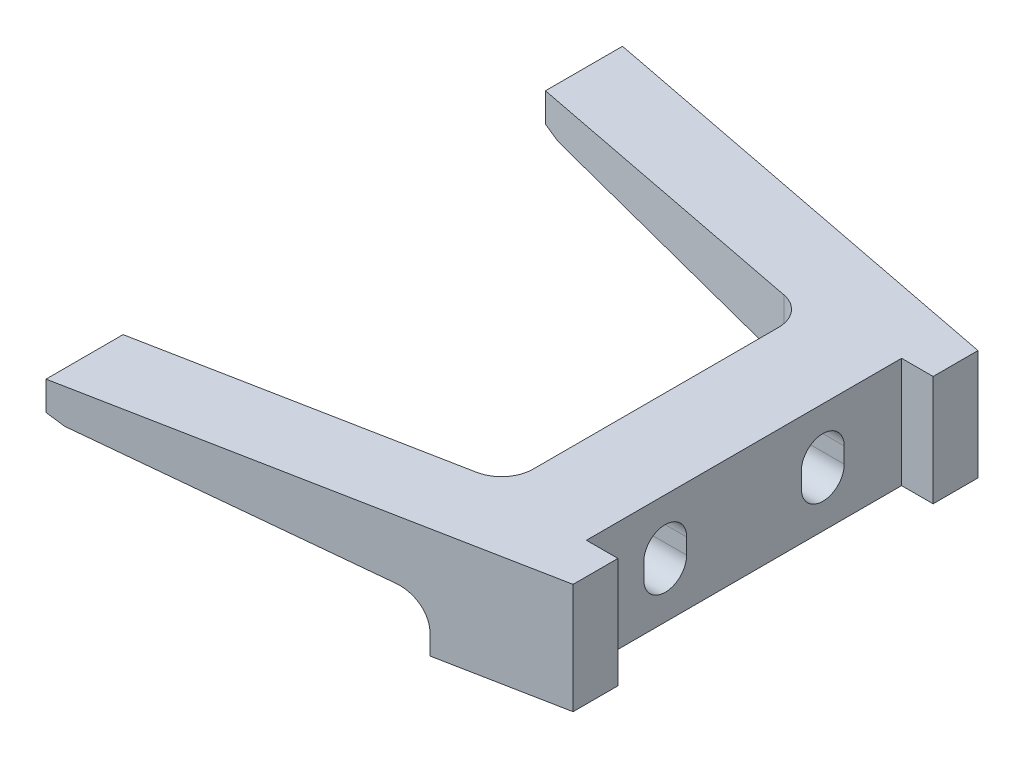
ISO-10303-21;
HEADER;
FILE_DESCRIPTION(('STEP AP214'),'2;1');
FILE_NAME('part.step','',(''),(''),'','','');
FILE_SCHEMA(('AUTOMOTIVE_DESIGN { 1 0 10303 214 1 1 1 1 }'));
ENDSEC;
DATA;
#1=APPLICATION_CONTEXT('core data for automotive mechanical design processes');
#2=APPLICATION_PROTOCOL_DEFINITION('international standard','automotive_design',2000,#1);
#3=PRODUCT_CONTEXT('',#1,'mechanical');
#4=PRODUCT('Part','Part','',(#3));
#5=PRODUCT_RELATED_PRODUCT_CATEGORY('part','',(#4));
#6=PRODUCT_DEFINITION_FORMATION('','',#4);
#7=PRODUCT_DEFINITION_CONTEXT('part definition',#1,'design');
#8=PRODUCT_DEFINITION('design','',#6,#7);
#9=PRODUCT_DEFINITION_SHAPE('','',#8);
#10=(LENGTH_UNIT() NAMED_UNIT(*) SI_UNIT(.MILLI.,.METRE.));
#11=(NAMED_UNIT(*) PLANE_ANGLE_UNIT() SI_UNIT($,.RADIAN.));
#12=(NAMED_UNIT(*) SI_UNIT($,.STERADIAN.) SOLID_ANGLE_UNIT());
#13=UNCERTAINTY_MEASURE_WITH_UNIT(LENGTH_MEASURE(1.E-05),#10,'distance_accuracy_value','');
#14=(GEOMETRIC_REPRESENTATION_CONTEXT(3) GLOBAL_UNCERTAINTY_ASSIGNED_CONTEXT((#13)) GLOBAL_UNIT_ASSIGNED_CONTEXT((#10,
#11,#12)) REPRESENTATION_CONTEXT('',''));
#15=CARTESIAN_POINT('',(0.,0.,0.));
#16=DIRECTION('',(0.,0.,1.));
#17=DIRECTION('',(1.,0.,0.));
#18=AXIS2_PLACEMENT_3D('',#15,#16,#17);
#19=CARTESIAN_POINT('',(-9.652,-5.7912,11.9819949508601));
#20=DIRECTION('',(1.,0.,0.));
#21=DIRECTION('',(0.,0.,-1.));
#22=AXIS2_PLACEMENT_3D('',#19,#20,#21);
#23=PLANE('',#22);
#24=DIRECTION('',(0.,0.,1.));
#25=VECTOR('',#24,1.);
#26=CARTESIAN_POINT('',(-9.652,-7.27424060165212,11.9819949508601));
#27=LINE('',#26,#25);
#28=CARTESIAN_POINT('',(-9.652,-7.27424060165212,18.1920919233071));
#29=VERTEX_POINT('',#28);
#30=CARTESIAN_POINT('',(-9.652,-7.27424060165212,9.88818053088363));
#31=VERTEX_POINT('',#30);
#32=EDGE_CURVE('E462',#29,#31,#27,.F.);
#33=ORIENTED_EDGE('',*,*,#32,.T.);
#34=DIRECTION('',(0.,1.,0.));
#35=VECTOR('',#34,1.);
#36=CARTESIAN_POINT('',(-9.652,0.,9.88818053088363));
#37=LINE('',#36,#35);
#38=CARTESIAN_POINT('',(-9.652,0.,9.88818053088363));
#39=VERTEX_POINT('',#38);
#40=EDGE_CURVE('E382',#31,#39,#37,.T.);
#41=ORIENTED_EDGE('',*,*,#40,.T.);
#42=DIRECTION('',(0.,0.,-1.));
#43=VECTOR('',#42,1.);
#44=CARTESIAN_POINT('',(-9.652,0.,11.9819949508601));
#45=LINE('',#44,#43);
#46=CARTESIAN_POINT('',(-9.652,0.,-9.88818053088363));
#47=VERTEX_POINT('',#46);
#48=EDGE_CURVE('E346',#39,#47,#45,.T.);
#49=ORIENTED_EDGE('',*,*,#48,.T.);
#50=DIRECTION('',(0.,1.,0.));
#51=VECTOR('',#50,1.);
#52=CARTESIAN_POINT('',(-9.652,-5.7912,-9.88818053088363));
#53=LINE('',#52,#51);
#54=CARTESIAN_POINT('',(-9.652,-7.27424060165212,-9.88818053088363));
#55=VERTEX_POINT('',#54);
#56=EDGE_CURVE('E379',#47,#55,#53,.F.);
#57=ORIENTED_EDGE('',*,*,#56,.T.);
#58=DIRECTION('',(0.,0.,-1.));
#59=VECTOR('',#58,1.);
#60=CARTESIAN_POINT('',(-9.652,-7.27424060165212,-18.1920919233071));
#61=LINE('',#60,#59);
#62=CARTESIAN_POINT('',(-9.652,-7.27424060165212,-18.1920919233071));
#63=VERTEX_POINT('',#62);
#64=EDGE_CURVE('E413',#55,#63,#61,.T.);
#65=ORIENTED_EDGE('',*,*,#64,.T.);
#66=DIRECTION('',(0.,1.,0.));
#67=VECTOR('',#66,1.);
#68=CARTESIAN_POINT('',(-9.652,-8.89,-18.1920919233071));
#69=LINE('',#68,#67);
#70=CARTESIAN_POINT('',(-9.652,-8.89,-18.1920919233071));
#71=VERTEX_POINT('',#70);
#72=EDGE_CURVE('E289',#71,#63,#69,.T.);
#73=ORIENTED_EDGE('',*,*,#72,.F.);
#74=DIRECTION('',(0.,0.,1.));
#75=VECTOR('',#74,1.);
#76=CARTESIAN_POINT('',(-9.652,-8.89,18.1920919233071));
#77=LINE('',#76,#75);
#78=CARTESIAN_POINT('',(-9.652,-8.89,18.1920919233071));
#79=VERTEX_POINT('',#78);
#80=EDGE_CURVE('E292',#71,#79,#77,.T.);
#81=ORIENTED_EDGE('',*,*,#80,.T.);
#82=DIRECTION('',(0.,1.,0.));
#83=VECTOR('',#82,1.);
#84=CARTESIAN_POINT('',(-9.652,-8.89,18.1920919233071));
#85=LINE('',#84,#83);
#86=EDGE_CURVE('E307',#79,#29,#85,.T.);
#87=ORIENTED_EDGE('',*,*,#86,.T.);
#88=EDGE_LOOP('',(#33,#41,#49,#57,#65,#73,#81,#87));
#89=FACE_BOUND('',#88,.T.);
#90=DIRECTION('',(0.,-1.,0.));
#91=VECTOR('',#90,1.);
#92=CARTESIAN_POINT('',(-9.652,-5.7912,8.0772));
#93=LINE('',#92,#91);
#94=CARTESIAN_POINT('',(-9.652,-3.81,8.0772));
#95=VERTEX_POINT('',#94);
#96=CARTESIAN_POINT('',(-9.652,-5.08,8.0772));
#97=VERTEX_POINT('',#96);
#98=EDGE_CURVE('E274',#95,#97,#93,.T.);
#99=ORIENTED_EDGE('',*,*,#98,.T.);
#100=CARTESIAN_POINT('',(-9.652,-5.08,6.35));
#101=DIRECTION('',(1.,0.,0.));
#102=DIRECTION('',(0.,0.,-1.));
#103=AXIS2_PLACEMENT_3D('',#100,#101,#102);
#104=CIRCLE('',#103,1.7272);
#105=CARTESIAN_POINT('',(-9.652,-5.08,4.6228));
#106=VERTEX_POINT('',#105);
#107=EDGE_CURVE('E277',#97,#106,#104,.T.);
#108=ORIENTED_EDGE('',*,*,#107,.T.);
#109=DIRECTION('',(0.,1.,0.));
#110=VECTOR('',#109,1.);
#111=CARTESIAN_POINT('',(-9.652,-5.79120000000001,4.6228));
#112=LINE('',#111,#110);
#113=CARTESIAN_POINT('',(-9.652,-3.81,4.6228));
#114=VERTEX_POINT('',#113);
#115=EDGE_CURVE('E262',#106,#114,#112,.T.);
#116=ORIENTED_EDGE('',*,*,#115,.T.);
#117=CARTESIAN_POINT('',(-9.652,-3.81,6.35));
#118=DIRECTION('',(1.,0.,0.));
#119=DIRECTION('',(0.,0.,-1.));
#120=AXIS2_PLACEMENT_3D('',#117,#118,#119);
#121=CIRCLE('',#120,1.7272);
#122=EDGE_CURVE('E271',#114,#95,#121,.T.);
#123=ORIENTED_EDGE('',*,*,#122,.T.);
#124=EDGE_LOOP('',(#99,#108,#116,#123));
#125=FACE_BOUND('',#124,.T.);
#126=CARTESIAN_POINT('',(-9.652,-5.08,-6.35));
#127=DIRECTION('',(1.,0.,0.));
#128=DIRECTION('',(0.,0.,-1.));
#129=AXIS2_PLACEMENT_3D('',#126,#127,#128);
#130=CIRCLE('',#129,1.7272);
#131=CARTESIAN_POINT('',(-9.652,-5.08,-8.0772));
#132=VERTEX_POINT('',#131);
#133=CARTESIAN_POINT('',(-9.652,-5.08,-4.6228));
#134=VERTEX_POINT('',#133);
#135=EDGE_CURVE('E246',#132,#134,#130,.F.);
#136=ORIENTED_EDGE('',*,*,#135,.F.);
#137=DIRECTION('',(0.,-1.,0.));
#138=VECTOR('',#137,1.);
#139=CARTESIAN_POINT('',(-9.652,-5.7912,-8.0772));
#140=LINE('',#139,#138);
#141=CARTESIAN_POINT('',(-9.652,-3.81,-8.0772));
#142=VERTEX_POINT('',#141);
#143=EDGE_CURVE('E239',#142,#132,#140,.T.);
#144=ORIENTED_EDGE('',*,*,#143,.F.);
#145=CARTESIAN_POINT('',(-9.652,-3.81,-6.35));
#146=DIRECTION('',(1.,0.,0.));
#147=DIRECTION('',(0.,0.,-1.));
#148=AXIS2_PLACEMENT_3D('',#145,#146,#147);
#149=CIRCLE('',#148,1.7272);
#150=CARTESIAN_POINT('',(-9.652,-3.81,-4.6228));
#151=VERTEX_POINT('',#150);
#152=EDGE_CURVE('E220',#151,#142,#149,.F.);
#153=ORIENTED_EDGE('',*,*,#152,.F.);
#154=DIRECTION('',(0.,1.,0.));
#155=VECTOR('',#154,1.);
#156=CARTESIAN_POINT('',(-9.652,-5.79119999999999,-4.6228));
#157=LINE('',#156,#155);
#158=EDGE_CURVE('E244',#134,#151,#157,.T.);
#159=ORIENTED_EDGE('',*,*,#158,.F.);
#160=EDGE_LOOP('',(#136,#144,#153,#159));
#161=FACE_BOUND('',#160,.T.);
#162=ADVANCED_FACE('F30',(#89,#125,#161),#23,.F.);
#163=CARTESIAN_POINT('',(-2.54,0.,-12.7));
#164=DIRECTION('',(1.,0.,0.));
#165=DIRECTION('',(0.,1.,0.));
#166=AXIS2_PLACEMENT_3D('',#163,#164,#165);
#167=PLANE('',#166);
#168=DIRECTION('',(0.,0.,-1.));
#169=VECTOR('',#168,1.);
#170=CARTESIAN_POINT('',(-2.54,-8.89,12.7));
#171=LINE('',#170,#169);
#172=CARTESIAN_POINT('',(-2.54,-8.89,12.7));
#173=VERTEX_POINT('',#172);
#174=CARTESIAN_POINT('',(-2.54,-8.89,-12.7));
#175=VERTEX_POINT('',#174);
#176=EDGE_CURVE('E304',#173,#175,#171,.T.);
#177=ORIENTED_EDGE('',*,*,#176,.T.);
#178=DIRECTION('',(0.,1.,0.));
#179=VECTOR('',#178,1.);
#180=CARTESIAN_POINT('',(-2.54,-9.70919330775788,-12.7));
#181=LINE('',#180,#179);
#182=CARTESIAN_POINT('',(-2.54,0.,-12.7));
#183=VERTEX_POINT('',#182);
#184=EDGE_CURVE('E318',#175,#183,#181,.T.);
#185=ORIENTED_EDGE('',*,*,#184,.T.);
#186=DIRECTION('',(0.,0.,1.));
#187=VECTOR('',#186,1.);
#188=CARTESIAN_POINT('',(-2.54,0.,-12.7));
#189=LINE('',#188,#187);
#190=CARTESIAN_POINT('',(-2.54,0.,12.7));
#191=VERTEX_POINT('',#190);
#192=EDGE_CURVE('E320',#183,#191,#189,.T.);
#193=ORIENTED_EDGE('',*,*,#192,.T.);
#194=DIRECTION('',(0.,1.,0.));
#195=VECTOR('',#194,1.);
#196=CARTESIAN_POINT('',(-2.54,-9.70919330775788,12.7));
#197=LINE('',#196,#195);
#198=EDGE_CURVE('E313',#173,#191,#197,.T.);
#199=ORIENTED_EDGE('',*,*,#198,.F.);
#200=EDGE_LOOP('',(#177,#185,#193,#199));
#201=FACE_BOUND('',#200,.T.);
#202=CARTESIAN_POINT('',(-2.54,-5.08,6.35));
#203=DIRECTION('',(1.,0.,0.));
#204=DIRECTION('',(0.,1.,0.));
#205=AXIS2_PLACEMENT_3D('',#202,#203,#204);
#206=CIRCLE('',#205,1.7272);
#207=CARTESIAN_POINT('',(-2.54,-5.08,8.0772));
#208=VERTEX_POINT('',#207);
#209=CARTESIAN_POINT('',(-2.54,-5.08,4.6228));
#210=VERTEX_POINT('',#209);
#211=EDGE_CURVE('E248',#208,#210,#206,.T.);
#212=ORIENTED_EDGE('',*,*,#211,.F.);
#213=DIRECTION('',(0.,-1.,0.));
#214=VECTOR('',#213,1.);
#215=CARTESIAN_POINT('',(-2.54,-5.08,8.0772));
#216=LINE('',#215,#214);
#217=CARTESIAN_POINT('',(-2.54,-3.81,8.0772));
#218=VERTEX_POINT('',#217);
#219=EDGE_CURVE('E256',#218,#208,#216,.T.);
#220=ORIENTED_EDGE('',*,*,#219,.F.);
#221=CARTESIAN_POINT('',(-2.54,-3.81,6.35));
#222=DIRECTION('',(1.,0.,0.));
#223=DIRECTION('',(0.,1.,0.));
#224=AXIS2_PLACEMENT_3D('',#221,#222,#223);
#225=CIRCLE('',#224,1.7272);
#226=CARTESIAN_POINT('',(-2.54,-3.81,4.6228));
#227=VERTEX_POINT('',#226);
#228=EDGE_CURVE('E253',#227,#218,#225,.T.);
#229=ORIENTED_EDGE('',*,*,#228,.F.);
#230=DIRECTION('',(0.,1.,0.));
#231=VECTOR('',#230,1.);
#232=CARTESIAN_POINT('',(-2.54,-5.08,4.6228));
#233=LINE('',#232,#231);
#234=EDGE_CURVE('E250',#210,#227,#233,.T.);
#235=ORIENTED_EDGE('',*,*,#234,.F.);
#236=EDGE_LOOP('',(#212,#220,#229,#235));
#237=FACE_BOUND('',#236,.T.);
#238=DIRECTION('',(0.,-1.,0.));
#239=VECTOR('',#238,1.);
#240=CARTESIAN_POINT('',(-2.54,-5.08,-8.0772));
#241=LINE('',#240,#239);
#242=CARTESIAN_POINT('',(-2.54,-3.81,-8.0772));
#243=VERTEX_POINT('',#242);
#244=CARTESIAN_POINT('',(-2.54,-5.08,-8.0772));
#245=VERTEX_POINT('',#244);
#246=EDGE_CURVE('E226',#243,#245,#241,.T.);
#247=ORIENTED_EDGE('',*,*,#246,.T.);
#248=CARTESIAN_POINT('',(-2.54,-5.08,-6.35));
#249=DIRECTION('',(-1.,0.,0.));
#250=DIRECTION('',(0.,1.,0.));
#251=AXIS2_PLACEMENT_3D('',#248,#249,#250);
#252=CIRCLE('',#251,1.7272);
#253=CARTESIAN_POINT('',(-2.54,-5.08,-4.6228));
#254=VERTEX_POINT('',#253);
#255=EDGE_CURVE('E53',#245,#254,#252,.T.);
#256=ORIENTED_EDGE('',*,*,#255,.T.);
#257=DIRECTION('',(0.,1.,0.));
#258=VECTOR('',#257,1.);
#259=CARTESIAN_POINT('',(-2.54,-5.08,-4.6228));
#260=LINE('',#259,#258);
#261=CARTESIAN_POINT('',(-2.54,-3.81,-4.6228));
#262=VERTEX_POINT('',#261);
#263=EDGE_CURVE('E232',#254,#262,#260,.T.);
#264=ORIENTED_EDGE('',*,*,#263,.T.);
#265=CARTESIAN_POINT('',(-2.54,-3.81,-6.35));
#266=DIRECTION('',(-1.,0.,0.));
#267=DIRECTION('',(0.,1.,0.));
#268=AXIS2_PLACEMENT_3D('',#265,#266,#267);
#269=CIRCLE('',#268,1.7272);
#270=EDGE_CURVE('E217',#262,#243,#269,.T.);
#271=ORIENTED_EDGE('',*,*,#270,.T.);
#272=EDGE_LOOP('',(#247,#256,#264,#271));
#273=FACE_BOUND('',#272,.T.);
#274=ADVANCED_FACE('F230',(#201,#237,#273),#167,.T.);
#275=CARTESIAN_POINT('',(0.,-5.7912,25.4));
#276=DIRECTION('',(0.0871557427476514,0.996194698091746,0.));
#277=DIRECTION('',(-0.996194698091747,0.0871557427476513,0.));
#278=AXIS2_PLACEMENT_3D('',#275,#276,#277);
#279=PLANE('',#278);
#280=DIRECTION('',(0.978027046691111,-0.085566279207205,0.190109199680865));
#281=VECTOR('',#280,1.);
#282=CARTESIAN_POINT('',(6.60166897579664,-6.36877119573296,-8.82260175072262));
#283=LINE('',#282,#281);
#284=CARTESIAN_POINT('',(-34.2948327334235,-2.79079091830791,-16.7720763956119));
#285=VERTEX_POINT('',#284);
#286=CARTESIAN_POINT('',(-11.970624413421,-4.74390606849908,-12.4326898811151));
#287=VERTEX_POINT('',#286);
#288=EDGE_CURVE('E330',#285,#287,#283,.T.);
#289=ORIENTED_EDGE('',*,*,#288,.F.);
#290=DIRECTION('',(0.,0.,-1.));
#291=VECTOR('',#290,1.);
#292=CARTESIAN_POINT('',(-34.2948327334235,-2.79079091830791,-23.228096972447));
#293=LINE('',#292,#291);
#294=CARTESIAN_POINT('',(-34.2948327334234,-2.79079091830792,-22.9821733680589));
#295=VERTEX_POINT('',#294);
#296=EDGE_CURVE('E437',#285,#295,#293,.T.);
#297=ORIENTED_EDGE('',*,*,#296,.T.);
#298=DIRECTION('',(-0.978027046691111,0.085566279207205,-0.190109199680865));
#299=VECTOR('',#298,1.);
#300=CARTESIAN_POINT('',(7.75632434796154,-6.46979045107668,-14.8082564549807));
#301=LINE('',#300,#299);
#302=CARTESIAN_POINT('',(-11.970624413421,-4.74390606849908,-18.6427868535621));
#303=VERTEX_POINT('',#302);
#304=EDGE_CURVE('E337',#303,#295,#301,.T.);
#305=ORIENTED_EDGE('',*,*,#304,.F.);
#306=DIRECTION('',(0.,0.,-1.));
#307=VECTOR('',#306,1.);
#308=CARTESIAN_POINT('',(-11.970624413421,-4.74390606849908,-11.9819949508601));
#309=LINE('',#308,#307);
#310=EDGE_CURVE('E424',#303,#287,#309,.F.);
#311=ORIENTED_EDGE('',*,*,#310,.T.);
#312=EDGE_LOOP('',(#289,#297,#305,#311));
#313=FACE_BOUND('',#312,.T.);
#314=ADVANCED_FACE('F455',(#313),#279,.F.);
#315=DIRECTION('',(-0.978027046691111,0.085566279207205,0.190109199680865));
#316=VECTOR('',#315,1.);
#317=CARTESIAN_POINT('',(-1.68901815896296,-5.64343005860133,16.6442450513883));
#318=LINE('',#317,#316);
#319=CARTESIAN_POINT('',(-11.970624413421,-4.74390606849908,18.6427868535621));
#320=VERTEX_POINT('',#319);
#321=CARTESIAN_POINT('',(-34.2948327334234,-2.79079091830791,22.9821733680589));
#322=VERTEX_POINT('',#321);
#323=EDGE_CURVE('E357',#320,#322,#318,.T.);
#324=ORIENTED_EDGE('',*,*,#323,.T.);
#325=DIRECTION('',(0.,0.,-1.));
#326=VECTOR('',#325,1.);
#327=CARTESIAN_POINT('',(-34.2948327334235,-2.79079091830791,25.4));
#328=LINE('',#327,#326);
#329=CARTESIAN_POINT('',(-34.2948327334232,-2.79079091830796,16.7720763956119));
#330=VERTEX_POINT('',#329);
#331=EDGE_CURVE('E418',#322,#330,#328,.T.);
#332=ORIENTED_EDGE('',*,*,#331,.T.);
#333=DIRECTION('',(0.978027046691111,-0.085566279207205,-0.190109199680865));
#334=VECTOR('',#333,1.);
#335=CARTESIAN_POINT('',(-2.84367353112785,-5.5424108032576,10.6585903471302));
#336=LINE('',#335,#334);
#337=CARTESIAN_POINT('',(-11.970624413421,-4.74390606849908,12.4326898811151));
#338=VERTEX_POINT('',#337);
#339=EDGE_CURVE('E349',#330,#338,#336,.T.);
#340=ORIENTED_EDGE('',*,*,#339,.T.);
#341=DIRECTION('',(0.,0.,1.));
#342=VECTOR('',#341,1.);
#343=CARTESIAN_POINT('',(-11.970624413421,-4.74390606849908,18.1920919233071));
#344=LINE('',#343,#342);
#345=EDGE_CURVE('E464',#338,#320,#344,.T.);
#346=ORIENTED_EDGE('',*,*,#345,.T.);
#347=EDGE_LOOP('',(#324,#332,#340,#346));
#348=FACE_BOUND('',#347,.T.);
#349=ADVANCED_FACE('F518',(#348),#279,.F.);
#350=CARTESIAN_POINT('',(-35.56,0.,25.4));
#351=DIRECTION('',(0.,-1.,0.));
#352=DIRECTION('',(0.,0.,-1.));
#353=AXIS2_PLACEMENT_3D('',#350,#351,#352);
#354=PLANE('',#353);
#355=DIRECTION('',(-0.981627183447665,0.,-0.190808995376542));
#356=VECTOR('',#355,1.);
#357=CARTESIAN_POINT('',(0.,0.,-16.3159331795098));
#358=LINE('',#357,#356);
#359=CARTESIAN_POINT('',(0.,0.,-16.3159331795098));
#360=VERTEX_POINT('',#359);
#361=CARTESIAN_POINT('',(-35.56,0.,-23.228096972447));
#362=VERTEX_POINT('',#361);
#363=EDGE_CURVE('E332',#360,#362,#358,.T.);
#364=ORIENTED_EDGE('',*,*,#363,.T.);
#365=DIRECTION('',(0.,0.,1.));
#366=VECTOR('',#365,1.);
#367=CARTESIAN_POINT('',(-35.56,0.,-25.4));
#368=LINE('',#367,#366);
#369=CARTESIAN_POINT('',(-35.56,0.,-17.018));
#370=VERTEX_POINT('',#369);
#371=EDGE_CURVE('E340',#362,#370,#368,.T.);
#372=ORIENTED_EDGE('',*,*,#371,.T.);
#373=DIRECTION('',(0.981627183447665,0.,0.190808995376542));
#374=VECTOR('',#373,1.);
#375=CARTESIAN_POINT('',(-35.56,0.,-17.018));
#376=LINE('',#375,#374);
#377=CARTESIAN_POINT('',(-11.7073451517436,0.,-12.3815135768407));
#378=VERTEX_POINT('',#377);
#379=EDGE_CURVE('E325',#370,#378,#376,.T.);
#380=ORIENTED_EDGE('',*,*,#379,.T.);
#381=CARTESIAN_POINT('',(-12.192,0.,-9.88818053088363));
#382=DIRECTION('',(0.,-1.,0.));
#383=DIRECTION('',(0.,0.,-1.));
#384=AXIS2_PLACEMENT_3D('',#381,#382,#383);
#385=CIRCLE('',#384,2.54);
#386=EDGE_CURVE('E38',#378,#47,#385,.T.);
#387=ORIENTED_EDGE('',*,*,#386,.T.);
#388=ORIENTED_EDGE('',*,*,#48,.F.);
#389=CARTESIAN_POINT('',(-12.192,0.,9.88818053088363));
#390=DIRECTION('',(0.,-1.,0.));
#391=DIRECTION('',(0.,0.,-1.));
#392=AXIS2_PLACEMENT_3D('',#389,#390,#391);
#393=CIRCLE('',#392,2.54);
#394=CARTESIAN_POINT('',(-11.7073451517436,0.,12.3815135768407));
#395=VERTEX_POINT('',#394);
#396=EDGE_CURVE('E390',#39,#395,#393,.T.);
#397=ORIENTED_EDGE('',*,*,#396,.T.);
#398=DIRECTION('',(0.981627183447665,0.,-0.190808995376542));
#399=VECTOR('',#398,1.);
#400=CARTESIAN_POINT('',(-35.56,0.,17.018));
#401=LINE('',#400,#399);
#402=CARTESIAN_POINT('',(-35.56,0.,17.018));
#403=VERTEX_POINT('',#402);
#404=EDGE_CURVE('E343',#403,#395,#401,.T.);
#405=ORIENTED_EDGE('',*,*,#404,.F.);
#406=DIRECTION('',(0.,0.,-1.));
#407=VECTOR('',#406,1.);
#408=CARTESIAN_POINT('',(-35.56,0.,25.4));
#409=LINE('',#408,#407);
#410=CARTESIAN_POINT('',(-35.56,0.,23.228096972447));
#411=VERTEX_POINT('',#410);
#412=EDGE_CURVE('E362',#411,#403,#409,.T.);
#413=ORIENTED_EDGE('',*,*,#412,.F.);
#414=DIRECTION('',(-0.981627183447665,0.,0.190808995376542));
#415=VECTOR('',#414,1.);
#416=CARTESIAN_POINT('',(0.,0.,16.3159331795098));
#417=LINE('',#416,#415);
#418=CARTESIAN_POINT('',(0.,0.,16.3159331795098));
#419=VERTEX_POINT('',#418);
#420=EDGE_CURVE('E352',#419,#411,#417,.T.);
#421=ORIENTED_EDGE('',*,*,#420,.F.);
#422=DIRECTION('',(0.,0.,-1.));
#423=VECTOR('',#422,1.);
#424=CARTESIAN_POINT('',(0.,0.,25.4));
#425=LINE('',#424,#423);
#426=CARTESIAN_POINT('',(0.,0.,12.7));
#427=VERTEX_POINT('',#426);
#428=EDGE_CURVE('E366',#419,#427,#425,.T.);
#429=ORIENTED_EDGE('',*,*,#428,.T.);
#430=DIRECTION('',(1.,0.,0.));
#431=VECTOR('',#430,1.);
#432=CARTESIAN_POINT('',(-2.54,0.,12.7));
#433=LINE('',#432,#431);
#434=EDGE_CURVE('E316',#191,#427,#433,.T.);
#435=ORIENTED_EDGE('',*,*,#434,.F.);
#436=ORIENTED_EDGE('',*,*,#192,.F.);
#437=DIRECTION('',(1.,0.,0.));
#438=VECTOR('',#437,1.);
#439=CARTESIAN_POINT('',(-2.54,0.,-12.7));
#440=LINE('',#439,#438);
#441=CARTESIAN_POINT('',(0.,0.,-12.7));
#442=VERTEX_POINT('',#441);
#443=EDGE_CURVE('E322',#183,#442,#440,.T.);
#444=ORIENTED_EDGE('',*,*,#443,.T.);
#445=EDGE_CURVE('E365',#442,#360,#425,.T.);
#446=ORIENTED_EDGE('',*,*,#445,.T.);
#447=EDGE_LOOP('',(#364,#372,#380,#387,#388,#397,#405,#413,#421,#429,#435,#436,#444,#446));
#448=FACE_BOUND('',#447,.T.);
#449=ADVANCED_FACE('F396',(#448),#354,.F.);
#450=CARTESIAN_POINT('',(0.,0.,25.4));
#451=DIRECTION('',(-1.,0.,0.));
#452=DIRECTION('',(0.,-1.,0.));
#453=AXIS2_PLACEMENT_3D('',#450,#451,#452);
#454=PLANE('',#453);
#455=DIRECTION('',(0.,1.,0.));
#456=VECTOR('',#455,1.);
#457=CARTESIAN_POINT('',(0.,-9.70919330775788,12.7));
#458=LINE('',#457,#456);
#459=CARTESIAN_POINT('',(0.,-8.89,12.7));
#460=VERTEX_POINT('',#459);
#461=EDGE_CURVE('E310',#460,#427,#458,.T.);
#462=ORIENTED_EDGE('',*,*,#461,.T.);
#463=ORIENTED_EDGE('',*,*,#428,.F.);
#464=DIRECTION('',(0.,1.,0.));
#465=VECTOR('',#464,1.);
#466=CARTESIAN_POINT('',(0.,-5.7912,16.3159331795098));
#467=LINE('',#466,#465);
#468=CARTESIAN_POINT('',(0.,-8.89,16.3159331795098));
#469=VERTEX_POINT('',#468);
#470=EDGE_CURVE('E355',#469,#419,#467,.T.);
#471=ORIENTED_EDGE('',*,*,#470,.F.);
#472=DIRECTION('',(0.,0.,-1.));
#473=VECTOR('',#472,1.);
#474=CARTESIAN_POINT('',(0.,-8.89,12.7));
#475=LINE('',#474,#473);
#476=EDGE_CURVE('E298',#469,#460,#475,.T.);
#477=ORIENTED_EDGE('',*,*,#476,.T.);
#478=EDGE_LOOP('',(#462,#463,#471,#477));
#479=FACE_BOUND('',#478,.T.);
#480=ADVANCED_FACE('F488',(#479),#454,.F.);
#481=ORIENTED_EDGE('',*,*,#445,.F.);
#482=DIRECTION('',(0.,-1.,0.));
#483=VECTOR('',#482,1.);
#484=CARTESIAN_POINT('',(0.,0.,-12.7));
#485=LINE('',#484,#483);
#486=CARTESIAN_POINT('',(0.,-8.89,-12.7));
#487=VERTEX_POINT('',#486);
#488=EDGE_CURVE('E453',#442,#487,#485,.T.);
#489=ORIENTED_EDGE('',*,*,#488,.T.);
#490=DIRECTION('',(0.,0.,1.));
#491=VECTOR('',#490,1.);
#492=CARTESIAN_POINT('',(0.,-8.89,-12.7));
#493=LINE('',#492,#491);
#494=CARTESIAN_POINT('',(0.,-8.89,-16.3159331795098));
#495=VERTEX_POINT('',#494);
#496=EDGE_CURVE('E283',#495,#487,#493,.T.);
#497=ORIENTED_EDGE('',*,*,#496,.F.);
#498=DIRECTION('',(0.,1.,0.));
#499=VECTOR('',#498,1.);
#500=CARTESIAN_POINT('',(0.,-5.7912,-16.3159331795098));
#501=LINE('',#500,#499);
#502=EDGE_CURVE('E334',#495,#360,#501,.T.);
#503=ORIENTED_EDGE('',*,*,#502,.T.);
#504=EDGE_LOOP('',(#481,#489,#497,#503));
#505=FACE_BOUND('',#504,.T.);
#506=ADVANCED_FACE('F469',(#505),#454,.F.);
#507=CARTESIAN_POINT('',(-35.56,-2.68010312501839,-25.4));
#508=DIRECTION('',(-1.,0.,0.));
#509=DIRECTION('',(0.,0.,1.));
#510=AXIS2_PLACEMENT_3D('',#507,#508,#509);
#511=PLANE('',#510);
#512=DIRECTION('',(0.,-1.,0.));
#513=VECTOR('',#512,1.);
#514=CARTESIAN_POINT('',(-35.56,-2.68010312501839,-23.228096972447));
#515=LINE('',#514,#513);
#516=CARTESIAN_POINT('',(-35.56,-2.33030769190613,-23.228096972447));
#517=VERTEX_POINT('',#516);
#518=EDGE_CURVE('E369',#362,#517,#515,.T.);
#519=ORIENTED_EDGE('',*,*,#518,.T.);
#520=DIRECTION('',(0.,0.,1.));
#521=VECTOR('',#520,1.);
#522=CARTESIAN_POINT('',(-35.56,-2.33030769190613,-17.018));
#523=LINE('',#522,#521);
#524=CARTESIAN_POINT('',(-35.56,-2.33030769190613,-17.018));
#525=VERTEX_POINT('',#524);
#526=EDGE_CURVE('E433',#517,#525,#523,.T.);
#527=ORIENTED_EDGE('',*,*,#526,.T.);
#528=DIRECTION('',(0.,1.,0.));
#529=VECTOR('',#528,1.);
#530=CARTESIAN_POINT('',(-35.56,-5.7912,-17.018));
#531=LINE('',#530,#529);
#532=EDGE_CURVE('E328',#525,#370,#531,.T.);
#533=ORIENTED_EDGE('',*,*,#532,.T.);
#534=ORIENTED_EDGE('',*,*,#371,.F.);
#535=EDGE_LOOP('',(#519,#527,#533,#534));
#536=FACE_BOUND('',#535,.T.);
#537=ADVANCED_FACE('F451',(#536),#511,.T.);
#538=CARTESIAN_POINT('',(-35.56,-2.68010312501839,25.4));
#539=DIRECTION('',(1.,0.,0.));
#540=DIRECTION('',(0.,0.,-1.));
#541=AXIS2_PLACEMENT_3D('',#538,#539,#540);
#542=PLANE('',#541);
#543=DIRECTION('',(0.,1.,0.));
#544=VECTOR('',#543,1.);
#545=CARTESIAN_POINT('',(-35.56,-5.7912,17.018));
#546=LINE('',#545,#544);
#547=CARTESIAN_POINT('',(-35.56,-2.33030769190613,17.018));
#548=VERTEX_POINT('',#547);
#549=EDGE_CURVE('E347',#548,#403,#546,.T.);
#550=ORIENTED_EDGE('',*,*,#549,.F.);
#551=DIRECTION('',(0.,0.,1.));
#552=VECTOR('',#551,1.);
#553=CARTESIAN_POINT('',(-35.56,-2.33030769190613,25.4));
#554=LINE('',#553,#552);
#555=CARTESIAN_POINT('',(-35.56,-2.33030769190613,23.228096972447));
#556=VERTEX_POINT('',#555);
#557=EDGE_CURVE('E429',#548,#556,#554,.T.);
#558=ORIENTED_EDGE('',*,*,#557,.T.);
#559=DIRECTION('',(0.,1.,0.));
#560=VECTOR('',#559,1.);
#561=CARTESIAN_POINT('',(-35.56,-2.68010312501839,23.228096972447));
#562=LINE('',#561,#560);
#563=EDGE_CURVE('E360',#556,#411,#562,.T.);
#564=ORIENTED_EDGE('',*,*,#563,.T.);
#565=ORIENTED_EDGE('',*,*,#412,.T.);
#566=EDGE_LOOP('',(#550,#558,#564,#565));
#567=FACE_BOUND('',#566,.T.);
#568=ADVANCED_FACE('F32',(#567),#542,.F.);
#569=CARTESIAN_POINT('',(0.,-5.7912,16.3159331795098));
#570=DIRECTION('',(-0.190808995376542,0.,-0.981627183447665));
#571=DIRECTION('',(-0.981627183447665,0.,0.190808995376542));
#572=AXIS2_PLACEMENT_3D('',#569,#570,#571);
#573=PLANE('',#572);
#574=ORIENTED_EDGE('',*,*,#563,.F.);
#575=DIRECTION('',(-0.92439839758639,0.33645350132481,0.179684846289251));
#576=VECTOR('',#575,1.);
#577=CARTESIAN_POINT('',(-34.6964346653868,-2.64461976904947,23.0602368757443));
#578=LINE('',#577,#576);
#579=EDGE_CURVE('E431',#556,#322,#578,.F.);
#580=ORIENTED_EDGE('',*,*,#579,.T.);
#581=ORIENTED_EDGE('',*,*,#323,.F.);
#582=CARTESIAN_POINT('',(-12.192,-7.27424060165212,18.6858179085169));
#583=DIRECTION('',(-0.190808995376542,0.,-0.981627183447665));
#584=DIRECTION('',(0.981627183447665,0.,-0.190808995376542));
#585=AXIS2_PLACEMENT_3D('',#582,#583,#584);
#586=ELLIPSE('',#585,2.58754040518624,2.54);
#587=EDGE_CURVE('E460',#320,#29,#586,.T.);
#588=ORIENTED_EDGE('',*,*,#587,.T.);
#589=ORIENTED_EDGE('',*,*,#86,.F.);
#590=DIRECTION('',(0.981627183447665,0.,-0.190808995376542));
#591=VECTOR('',#590,1.);
#592=CARTESIAN_POINT('',(-9.652,-8.89,18.1920919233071));
#593=LINE('',#592,#591);
#594=EDGE_CURVE('E295',#79,#469,#593,.T.);
#595=ORIENTED_EDGE('',*,*,#594,.T.);
#596=ORIENTED_EDGE('',*,*,#470,.T.);
#597=ORIENTED_EDGE('',*,*,#420,.T.);
#598=EDGE_LOOP('',(#574,#580,#581,#588,#589,#595,#596,#597));
#599=FACE_BOUND('',#598,.T.);
#600=ADVANCED_FACE('F494',(#599),#573,.F.);
#601=CARTESIAN_POINT('',(-35.56,-5.7912,17.018));
#602=DIRECTION('',(0.190808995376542,0.,0.981627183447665));
#603=DIRECTION('',(0.981627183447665,0.,-0.190808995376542));
#604=AXIS2_PLACEMENT_3D('',#601,#602,#603);
#605=PLANE('',#604);
#606=ORIENTED_EDGE('',*,*,#404,.T.);
#607=DIRECTION('',(0.,1.,0.));
#608=VECTOR('',#607,1.);
#609=CARTESIAN_POINT('',(-11.7073451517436,-7.27424060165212,12.3815135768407));
#610=LINE('',#609,#608);
#611=CARTESIAN_POINT('',(-11.7073451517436,-4.78090755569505,12.3815135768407));
#612=VERTEX_POINT('',#611);
#613=EDGE_CURVE('E385',#395,#612,#610,.F.);
#614=ORIENTED_EDGE('',*,*,#613,.T.);
#615=CARTESIAN_POINT('',(-12.192,-7.27424060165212,12.4757209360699));
#616=DIRECTION('',(0.190808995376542,0.,0.981627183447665));
#617=DIRECTION('',(0.981627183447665,0.,-0.190808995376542));
#618=AXIS2_PLACEMENT_3D('',#615,#616,#617);
#619=ELLIPSE('',#618,2.58754040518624,2.54);
#620=EDGE_CURVE('E456',#612,#338,#619,.T.);
#621=ORIENTED_EDGE('',*,*,#620,.T.);
#622=ORIENTED_EDGE('',*,*,#339,.F.);
#623=DIRECTION('',(0.92439839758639,-0.33645350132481,-0.179684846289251));
#624=VECTOR('',#623,1.);
#625=CARTESIAN_POINT('',(-35.7279341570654,-2.26918465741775,17.0506430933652));
#626=LINE('',#625,#624);
#627=EDGE_CURVE('E422',#330,#548,#626,.F.);
#628=ORIENTED_EDGE('',*,*,#627,.T.);
#629=ORIENTED_EDGE('',*,*,#549,.T.);
#630=EDGE_LOOP('',(#606,#614,#621,#622,#628,#629));
#631=FACE_BOUND('',#630,.T.);
#632=ADVANCED_FACE('F508',(#631),#605,.F.);
#633=CARTESIAN_POINT('',(0.,-5.7912,-16.3159331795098));
#634=DIRECTION('',(0.190808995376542,0.,-0.981627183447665));
#635=DIRECTION('',(-0.981627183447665,0.,-0.190808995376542));
#636=AXIS2_PLACEMENT_3D('',#633,#634,#635);
#637=PLANE('',#636);
#638=ORIENTED_EDGE('',*,*,#304,.T.);
#639=DIRECTION('',(-0.92439839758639,0.33645350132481,-0.179684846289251));
#640=VECTOR('',#639,1.);
#641=CARTESIAN_POINT('',(-2.94902947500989,-14.1997302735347,-16.8891664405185));
#642=LINE('',#641,#640);
#643=EDGE_CURVE('E377',#295,#517,#642,.T.);
#644=ORIENTED_EDGE('',*,*,#643,.T.);
#645=ORIENTED_EDGE('',*,*,#518,.F.);
#646=ORIENTED_EDGE('',*,*,#363,.F.);
#647=ORIENTED_EDGE('',*,*,#502,.F.);
#648=DIRECTION('',(0.981627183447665,0.,0.190808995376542));
#649=VECTOR('',#648,1.);
#650=CARTESIAN_POINT('',(-9.652,-8.89,-18.1920919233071));
#651=LINE('',#650,#649);
#652=EDGE_CURVE('E286',#71,#495,#651,.T.);
#653=ORIENTED_EDGE('',*,*,#652,.F.);
#654=ORIENTED_EDGE('',*,*,#72,.T.);
#655=CARTESIAN_POINT('',(-12.192,-7.27424060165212,-18.6858179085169));
#656=DIRECTION('',(0.190808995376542,0.,-0.981627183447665));
#657=DIRECTION('',(0.981627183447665,0.,0.190808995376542));
#658=AXIS2_PLACEMENT_3D('',#655,#656,#657);
#659=ELLIPSE('',#658,2.58754040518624,2.54);
#660=EDGE_CURVE('E419',#63,#303,#659,.F.);
#661=ORIENTED_EDGE('',*,*,#660,.T.);
#662=EDGE_LOOP('',(#638,#644,#645,#646,#647,#653,#654,#661));
#663=FACE_BOUND('',#662,.T.);
#664=ADVANCED_FACE('F445',(#663),#637,.T.);
#665=CARTESIAN_POINT('',(-35.56,-5.7912,-17.018));
#666=DIRECTION('',(-0.190808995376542,0.,0.981627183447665));
#667=DIRECTION('',(0.981627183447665,0.,0.190808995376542));
#668=AXIS2_PLACEMENT_3D('',#665,#666,#667);
#669=PLANE('',#668);
#670=CARTESIAN_POINT('',(-12.192,-7.27424060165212,-12.4757209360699));
#671=DIRECTION('',(-0.190808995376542,0.,0.981627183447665));
#672=DIRECTION('',(0.981627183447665,0.,0.190808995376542));
#673=AXIS2_PLACEMENT_3D('',#670,#671,#672);
#674=ELLIPSE('',#673,2.58754040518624,2.54);
#675=CARTESIAN_POINT('',(-11.7073451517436,-4.78090755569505,-12.3815135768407));
#676=VERTEX_POINT('',#675);
#677=EDGE_CURVE('E412',#287,#676,#674,.F.);
#678=ORIENTED_EDGE('',*,*,#677,.T.);
#679=DIRECTION('',(0.,1.,0.));
#680=VECTOR('',#679,1.);
#681=CARTESIAN_POINT('',(-11.7073451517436,-5.7912,-12.3815135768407));
#682=LINE('',#681,#680);
#683=EDGE_CURVE('E387',#676,#378,#682,.T.);
#684=ORIENTED_EDGE('',*,*,#683,.T.);
#685=ORIENTED_EDGE('',*,*,#379,.F.);
#686=ORIENTED_EDGE('',*,*,#532,.F.);
#687=DIRECTION('',(0.92439839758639,-0.33645350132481,0.179684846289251));
#688=VECTOR('',#687,1.);
#689=CARTESIAN_POINT('',(-34.4836033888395,-2.72208401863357,-16.8087696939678));
#690=LINE('',#689,#688);
#691=EDGE_CURVE('E436',#525,#285,#690,.T.);
#692=ORIENTED_EDGE('',*,*,#691,.T.);
#693=ORIENTED_EDGE('',*,*,#288,.T.);
#694=EDGE_LOOP('',(#678,#684,#685,#686,#692,#693));
#695=FACE_BOUND('',#694,.T.);
#696=ADVANCED_FACE('F415',(#695),#669,.T.);
#697=CARTESIAN_POINT('',(-2.54,-9.70919330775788,-12.7));
#698=DIRECTION('',(0.,0.,-1.));
#699=DIRECTION('',(-1.,0.,0.));
#700=AXIS2_PLACEMENT_3D('',#697,#698,#699);
#701=PLANE('',#700);
#702=ORIENTED_EDGE('',*,*,#488,.F.);
#703=ORIENTED_EDGE('',*,*,#443,.F.);
#704=ORIENTED_EDGE('',*,*,#184,.F.);
#705=DIRECTION('',(-1.,0.,0.));
#706=VECTOR('',#705,1.);
#707=CARTESIAN_POINT('',(-2.54,-8.89,-12.7));
#708=LINE('',#707,#706);
#709=EDGE_CURVE('E280',#487,#175,#708,.T.);
#710=ORIENTED_EDGE('',*,*,#709,.F.);
#711=EDGE_LOOP('',(#702,#703,#704,#710));
#712=FACE_BOUND('',#711,.T.);
#713=ADVANCED_FACE('F477',(#712),#701,.F.);
#714=CARTESIAN_POINT('',(-2.54,-9.70919330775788,12.7));
#715=DIRECTION('',(0.,0.,-1.));
#716=DIRECTION('',(-1.,0.,0.));
#717=AXIS2_PLACEMENT_3D('',#714,#715,#716);
#718=PLANE('',#717);
#719=ORIENTED_EDGE('',*,*,#461,.F.);
#720=DIRECTION('',(-1.,0.,0.));
#721=VECTOR('',#720,1.);
#722=CARTESIAN_POINT('',(-2.54,-8.89,12.7));
#723=LINE('',#722,#721);
#724=EDGE_CURVE('E301',#460,#173,#723,.T.);
#725=ORIENTED_EDGE('',*,*,#724,.T.);
#726=ORIENTED_EDGE('',*,*,#198,.T.);
#727=ORIENTED_EDGE('',*,*,#434,.T.);
#728=EDGE_LOOP('',(#719,#725,#726,#727));
#729=FACE_BOUND('',#728,.T.);
#730=ADVANCED_FACE('F484',(#729),#718,.T.);
#731=CARTESIAN_POINT('',(-9.652,-8.89,0.));
#732=DIRECTION('',(0.,-1.,0.));
#733=DIRECTION('',(0.,0.,-1.));
#734=AXIS2_PLACEMENT_3D('',#731,#732,#733);
#735=PLANE('',#734);
#736=ORIENTED_EDGE('',*,*,#80,.F.);
#737=ORIENTED_EDGE('',*,*,#652,.T.);
#738=ORIENTED_EDGE('',*,*,#496,.T.);
#739=ORIENTED_EDGE('',*,*,#709,.T.);
#740=ORIENTED_EDGE('',*,*,#176,.F.);
#741=ORIENTED_EDGE('',*,*,#724,.F.);
#742=ORIENTED_EDGE('',*,*,#476,.F.);
#743=ORIENTED_EDGE('',*,*,#594,.F.);
#744=EDGE_LOOP('',(#736,#737,#738,#739,#740,#741,#742,#743));
#745=FACE_BOUND('',#744,.T.);
#746=ADVANCED_FACE('F474',(#745),#735,.T.);
#747=CARTESIAN_POINT('',(-12.192,-7.27424060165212,25.4));
#748=DIRECTION('',(0.,0.,-1.));
#749=DIRECTION('',(-1.,0.,0.));
#750=AXIS2_PLACEMENT_3D('',#747,#748,#749);
#751=CYLINDRICAL_SURFACE('',#750,2.54);
#752=ORIENTED_EDGE('',*,*,#620,.F.);
#753=CARTESIAN_POINT('',(-12.192,-7.27424060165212,9.88818053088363));
#754=DIRECTION('',(0.,0.707106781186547,-0.707106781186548));
#755=DIRECTION('',(0.,-0.707106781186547,-0.707106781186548));
#756=AXIS2_PLACEMENT_3D('',#753,#754,#755);
#757=ELLIPSE('',#756,3.59210244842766,2.54);
#758=EDGE_CURVE('E392',#612,#31,#757,.T.);
#759=ORIENTED_EDGE('',*,*,#758,.T.);
#760=ORIENTED_EDGE('',*,*,#32,.F.);
#761=ORIENTED_EDGE('',*,*,#587,.F.);
#762=ORIENTED_EDGE('',*,*,#345,.F.);
#763=EDGE_LOOP('',(#752,#759,#760,#761,#762));
#764=FACE_BOUND('',#763,.T.);
#765=ADVANCED_FACE('F501',(#764),#751,.F.);
#766=CARTESIAN_POINT('',(-12.192,-7.27424060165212,11.9819949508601));
#767=DIRECTION('',(0.,0.,1.));
#768=DIRECTION('',(1.,0.,0.));
#769=AXIS2_PLACEMENT_3D('',#766,#767,#768);
#770=CYLINDRICAL_SURFACE('',#769,2.54);
#771=ORIENTED_EDGE('',*,*,#677,.F.);
#772=ORIENTED_EDGE('',*,*,#310,.F.);
#773=ORIENTED_EDGE('',*,*,#660,.F.);
#774=ORIENTED_EDGE('',*,*,#64,.F.);
#775=CARTESIAN_POINT('',(-12.192,-7.27424060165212,-9.88818053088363));
#776=DIRECTION('',(0.,0.707106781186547,0.707106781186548));
#777=DIRECTION('',(0.,-0.707106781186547,0.707106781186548));
#778=AXIS2_PLACEMENT_3D('',#775,#776,#777);
#779=ELLIPSE('',#778,3.59210244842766,2.54);
#780=EDGE_CURVE('E11',#55,#676,#779,.T.);
#781=ORIENTED_EDGE('',*,*,#780,.T.);
#782=EDGE_LOOP('',(#771,#772,#773,#774,#781));
#783=FACE_BOUND('',#782,.T.);
#784=ADVANCED_FACE('F410',(#783),#770,.F.);
#785=CARTESIAN_POINT('',(-34.2948327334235,-2.79079091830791,25.4));
#786=DIRECTION('',(0.34202014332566,0.939692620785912,0.));
#787=DIRECTION('',(-0.939692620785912,0.34202014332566,0.));
#788=AXIS2_PLACEMENT_3D('',#785,#786,#787);
#789=PLANE('',#788);
#790=ORIENTED_EDGE('',*,*,#579,.F.);
#791=ORIENTED_EDGE('',*,*,#557,.F.);
#792=ORIENTED_EDGE('',*,*,#627,.F.);
#793=ORIENTED_EDGE('',*,*,#331,.F.);
#794=EDGE_LOOP('',(#790,#791,#792,#793));
#795=FACE_BOUND('',#794,.T.);
#796=ADVANCED_FACE('F514',(#795),#789,.F.);
#797=CARTESIAN_POINT('',(-35.56,-2.33030769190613,-25.4));
#798=DIRECTION('',(-0.34202014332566,-0.939692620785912,0.));
#799=DIRECTION('',(0.939692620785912,-0.34202014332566,0.));
#800=AXIS2_PLACEMENT_3D('',#797,#798,#799);
#801=PLANE('',#800);
#802=ORIENTED_EDGE('',*,*,#643,.F.);
#803=ORIENTED_EDGE('',*,*,#296,.F.);
#804=ORIENTED_EDGE('',*,*,#691,.F.);
#805=ORIENTED_EDGE('',*,*,#526,.F.);
#806=EDGE_LOOP('',(#802,#803,#804,#805));
#807=FACE_BOUND('',#806,.T.);
#808=ADVANCED_FACE('F454',(#807),#801,.T.);
#809=CARTESIAN_POINT('',(-12.192,-5.7912,9.88818053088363));
#810=DIRECTION('',(0.,-1.,0.));
#811=DIRECTION('',(0.,0.,-1.));
#812=AXIS2_PLACEMENT_3D('',#809,#810,#811);
#813=CYLINDRICAL_SURFACE('',#812,2.54);
#814=ORIENTED_EDGE('',*,*,#758,.F.);
#815=ORIENTED_EDGE('',*,*,#613,.F.);
#816=ORIENTED_EDGE('',*,*,#396,.F.);
#817=ORIENTED_EDGE('',*,*,#40,.F.);
#818=EDGE_LOOP('',(#814,#815,#816,#817));
#819=FACE_BOUND('',#818,.T.);
#820=ADVANCED_FACE('F506',(#819),#813,.F.);
#821=CARTESIAN_POINT('',(-12.192,-5.7912,-9.88818053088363));
#822=DIRECTION('',(0.,1.,0.));
#823=DIRECTION('',(0.,0.,1.));
#824=AXIS2_PLACEMENT_3D('',#821,#822,#823);
#825=CYLINDRICAL_SURFACE('',#824,2.54);
#826=ORIENTED_EDGE('',*,*,#780,.F.);
#827=ORIENTED_EDGE('',*,*,#56,.F.);
#828=ORIENTED_EDGE('',*,*,#386,.F.);
#829=ORIENTED_EDGE('',*,*,#683,.F.);
#830=EDGE_LOOP('',(#826,#827,#828,#829));
#831=FACE_BOUND('',#830,.T.);
#832=ADVANCED_FACE('F406',(#831),#825,.F.);
#833=CARTESIAN_POINT('',(-35.56,-5.08,6.35));
#834=DIRECTION('',(1.,0.,0.));
#835=DIRECTION('',(0.,1.,0.));
#836=AXIS2_PLACEMENT_3D('',#833,#834,#835);
#837=CYLINDRICAL_SURFACE('',#836,1.7272);
#838=DIRECTION('',(1.,0.,0.));
#839=VECTOR('',#838,1.);
#840=CARTESIAN_POINT('',(-35.56,-5.08,8.0772));
#841=LINE('',#840,#839);
#842=EDGE_CURVE('E260',#97,#208,#841,.T.);
#843=ORIENTED_EDGE('',*,*,#842,.T.);
#844=ORIENTED_EDGE('',*,*,#211,.T.);
#845=DIRECTION('',(1.,0.,0.));
#846=VECTOR('',#845,1.);
#847=CARTESIAN_POINT('',(-35.56,-5.08,4.6228));
#848=LINE('',#847,#846);
#849=EDGE_CURVE('E259',#106,#210,#848,.T.);
#850=ORIENTED_EDGE('',*,*,#849,.F.);
#851=ORIENTED_EDGE('',*,*,#107,.F.);
#852=EDGE_LOOP('',(#843,#844,#850,#851));
#853=FACE_BOUND('',#852,.T.);
#854=ADVANCED_FACE('F631',(#853),#837,.F.);
#855=CARTESIAN_POINT('',(-35.56,-5.08,8.0772));
#856=DIRECTION('',(0.,0.,1.));
#857=DIRECTION('',(1.,0.,0.));
#858=AXIS2_PLACEMENT_3D('',#855,#856,#857);
#859=PLANE('',#858);
#860=DIRECTION('',(1.,0.,0.));
#861=VECTOR('',#860,1.);
#862=CARTESIAN_POINT('',(-35.56,-3.81,8.0772));
#863=LINE('',#862,#861);
#864=EDGE_CURVE('E263',#95,#218,#863,.T.);
#865=ORIENTED_EDGE('',*,*,#864,.T.);
#866=ORIENTED_EDGE('',*,*,#219,.T.);
#867=ORIENTED_EDGE('',*,*,#842,.F.);
#868=ORIENTED_EDGE('',*,*,#98,.F.);
#869=EDGE_LOOP('',(#865,#866,#867,#868));
#870=FACE_BOUND('',#869,.T.);
#871=ADVANCED_FACE('F638',(#870),#859,.F.);
#872=CARTESIAN_POINT('',(-35.56,-3.81,6.35));
#873=DIRECTION('',(1.,0.,0.));
#874=DIRECTION('',(0.,1.,0.));
#875=AXIS2_PLACEMENT_3D('',#872,#873,#874);
#876=CYLINDRICAL_SURFACE('',#875,1.7272);
#877=DIRECTION('',(1.,0.,0.));
#878=VECTOR('',#877,1.);
#879=CARTESIAN_POINT('',(-35.56,-3.81,4.6228));
#880=LINE('',#879,#878);
#881=EDGE_CURVE('E265',#114,#227,#880,.T.);
#882=ORIENTED_EDGE('',*,*,#881,.T.);
#883=ORIENTED_EDGE('',*,*,#228,.T.);
#884=ORIENTED_EDGE('',*,*,#864,.F.);
#885=ORIENTED_EDGE('',*,*,#122,.F.);
#886=EDGE_LOOP('',(#882,#883,#884,#885));
#887=FACE_BOUND('',#886,.T.);
#888=ADVANCED_FACE('F646',(#887),#876,.F.);
#889=CARTESIAN_POINT('',(-35.56,-5.08,4.6228));
#890=DIRECTION('',(0.,0.,-1.));
#891=DIRECTION('',(0.,1.,0.));
#892=AXIS2_PLACEMENT_3D('',#889,#890,#891);
#893=PLANE('',#892);
#894=ORIENTED_EDGE('',*,*,#849,.T.);
#895=ORIENTED_EDGE('',*,*,#234,.T.);
#896=ORIENTED_EDGE('',*,*,#881,.F.);
#897=ORIENTED_EDGE('',*,*,#115,.F.);
#898=EDGE_LOOP('',(#894,#895,#896,#897));
#899=FACE_BOUND('',#898,.T.);
#900=ADVANCED_FACE('F654',(#899),#893,.F.);
#901=CARTESIAN_POINT('',(-35.56,-5.08,-6.35));
#902=DIRECTION('',(1.,0.,0.));
#903=DIRECTION('',(0.,1.,0.));
#904=AXIS2_PLACEMENT_3D('',#901,#902,#903);
#905=CYLINDRICAL_SURFACE('',#904,1.7272);
#906=ORIENTED_EDGE('',*,*,#135,.T.);
#907=DIRECTION('',(1.,0.,0.));
#908=VECTOR('',#907,1.);
#909=CARTESIAN_POINT('',(-35.56,-5.08,-4.6228));
#910=LINE('',#909,#908);
#911=EDGE_CURVE('E237',#134,#254,#910,.T.);
#912=ORIENTED_EDGE('',*,*,#911,.T.);
#913=ORIENTED_EDGE('',*,*,#255,.F.);
#914=DIRECTION('',(1.,0.,0.));
#915=VECTOR('',#914,1.);
#916=CARTESIAN_POINT('',(-35.56,-5.08,-8.0772));
#917=LINE('',#916,#915);
#918=EDGE_CURVE('E223',#132,#245,#917,.T.);
#919=ORIENTED_EDGE('',*,*,#918,.F.);
#920=EDGE_LOOP('',(#906,#912,#913,#919));
#921=FACE_BOUND('',#920,.T.);
#922=ADVANCED_FACE('F662',(#921),#905,.F.);
#923=CARTESIAN_POINT('',(-35.56,-5.08,-4.6228));
#924=DIRECTION('',(0.,0.,-1.));
#925=DIRECTION('',(0.,1.,0.));
#926=AXIS2_PLACEMENT_3D('',#923,#924,#925);
#927=PLANE('',#926);
#928=ORIENTED_EDGE('',*,*,#158,.T.);
#929=DIRECTION('',(1.,0.,0.));
#930=VECTOR('',#929,1.);
#931=CARTESIAN_POINT('',(-35.56,-3.81,-4.6228));
#932=LINE('',#931,#930);
#933=EDGE_CURVE('E222',#151,#262,#932,.T.);
#934=ORIENTED_EDGE('',*,*,#933,.T.);
#935=ORIENTED_EDGE('',*,*,#263,.F.);
#936=ORIENTED_EDGE('',*,*,#911,.F.);
#937=EDGE_LOOP('',(#928,#934,#935,#936));
#938=FACE_BOUND('',#937,.T.);
#939=ADVANCED_FACE('F671',(#938),#927,.T.);
#940=CARTESIAN_POINT('',(-35.56,-3.81,-6.35));
#941=DIRECTION('',(1.,0.,0.));
#942=DIRECTION('',(0.,1.,0.));
#943=AXIS2_PLACEMENT_3D('',#940,#941,#942);
#944=CYLINDRICAL_SURFACE('',#943,1.7272);
#945=ORIENTED_EDGE('',*,*,#152,.T.);
#946=DIRECTION('',(1.,0.,0.));
#947=VECTOR('',#946,1.);
#948=CARTESIAN_POINT('',(-35.56,-3.81,-8.0772));
#949=LINE('',#948,#947);
#950=EDGE_CURVE('E45',#142,#243,#949,.T.);
#951=ORIENTED_EDGE('',*,*,#950,.T.);
#952=ORIENTED_EDGE('',*,*,#270,.F.);
#953=ORIENTED_EDGE('',*,*,#933,.F.);
#954=EDGE_LOOP('',(#945,#951,#952,#953));
#955=FACE_BOUND('',#954,.T.);
#956=ADVANCED_FACE('F214',(#955),#944,.F.);
#957=CARTESIAN_POINT('',(-35.56,-5.08,-8.0772));
#958=DIRECTION('',(0.,0.,1.));
#959=DIRECTION('',(1.,0.,0.));
#960=AXIS2_PLACEMENT_3D('',#957,#958,#959);
#961=PLANE('',#960);
#962=ORIENTED_EDGE('',*,*,#143,.T.);
#963=ORIENTED_EDGE('',*,*,#918,.T.);
#964=ORIENTED_EDGE('',*,*,#246,.F.);
#965=ORIENTED_EDGE('',*,*,#950,.F.);
#966=EDGE_LOOP('',(#962,#963,#964,#965));
#967=FACE_BOUND('',#966,.T.);
#968=ADVANCED_FACE('F227',(#967),#961,.T.);
#969=CLOSED_SHELL('',(#162,#274,#314,#349,#449,#480,#506,#537,#568,#600,#632,#664,#696,#713,
#730,#746,#765,#784,#796,#808,#820,#832,#854,#871,#888,#900,#922,#939,#956,#968));
#970=MANIFOLD_SOLID_BREP('B2',#969);
#971=ADVANCED_BREP_SHAPE_REPRESENTATION('',(#18,#970),#14);
#972=SHAPE_DEFINITION_REPRESENTATION(#9,#971);
ENDSEC;
END-ISO-10303-21;
